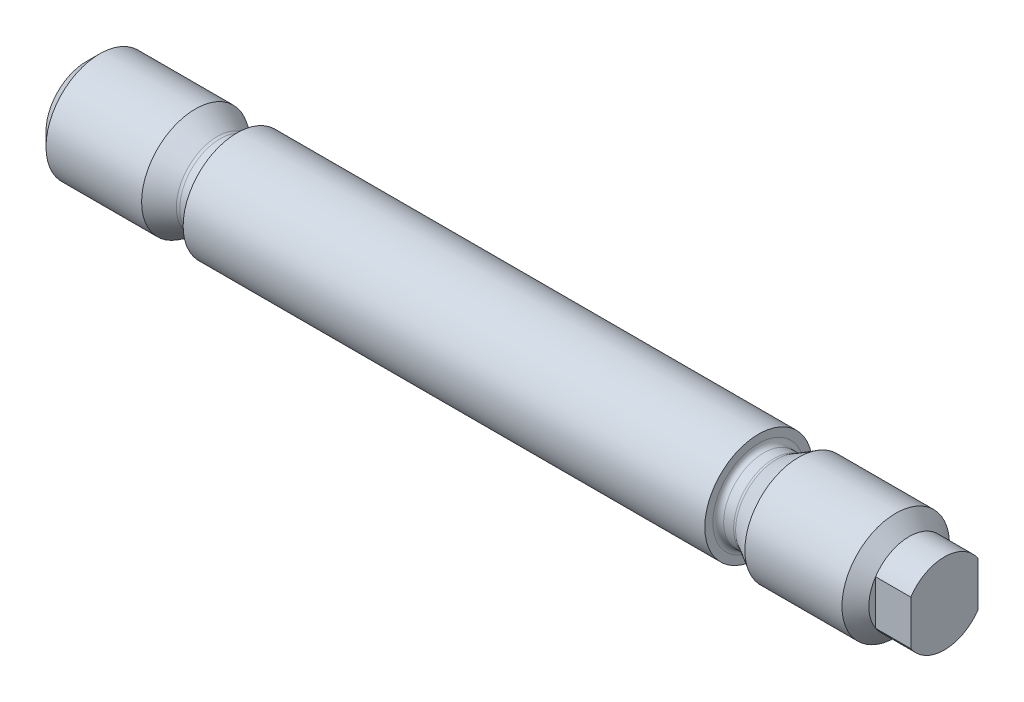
from build123d import *

# Parameters (mm, degrees)
DOGPOINT_DEPTH = 5.24


with BuildPart() as part:
    # BodySke → BaseBody (revolve)
    with BuildSketch(Plane.XY, mode=Mode.PRIVATE) as basebody_sk:
        with BuildLine():
            Line((19.5, 6.107179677), (16.221539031, 8))
            Line((16.221539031, 8), (2, 8))
            Line((2, 8), (0, 6))
            Line((0, 6), (0, 0))
            Line((0, 0), (122.4, 0))
            Line((122.4, 0), (122.4, 6))
            Line((122.4, 6), (120.4, 8))
            Line((120.4, 8), (105.964101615, 8))
            Line((105.964101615, 8), (102.685640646, 6.107179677))
            ThreePointArc((102.685640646, 6.107179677), (102.492695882, 6.027259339), (102.285640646, 6))
            Line((102.285640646, 6), (100.8, 6))
            ThreePointArc((100.8, 6), (100.234314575, 6.234314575), (100, 6.8))
            Line((100, 6.8), (100, 8))
            Line((100, 8), (22.4, 8))
            Line((22.4, 8), (22.4, 6.8))
            ThreePointArc((22.4, 6.8), (22.165685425, 6.234314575), (21.6, 6))
            Line((21.6, 6), (19.9, 6))
            ThreePointArc((19.9, 6), (19.692944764, 6.027259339), (19.5, 6.107179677))
        make_face()
    revolve(basebody_sk.sketch.rotate(Axis((-3.175, 0, 0), (1, 0, 0)), 90), axis=Axis((-3.175, 0, 0), (1, 0, 0)))

    # DogPointSke → DogPoint (add)
    with BuildSketch(Plane(origin=(122.4, 0, 0), x_dir=(0, 0, -1), z_dir=(1, 0, 0))):
        with BuildLine():
            Line((-5, 3.31662479), (-5, -3.31662479))
            ThreePointArc((-5, -3.31662479), (0, -6), (5, -3.31662479))
            Line((5, -3.31662479), (5, 3.31662479))
            ThreePointArc((5, 3.31662479), (0, 6), (-5, 3.31662479))
        make_face()
    extrude(amount=DOGPOINT_DEPTH)


solid = part.part
